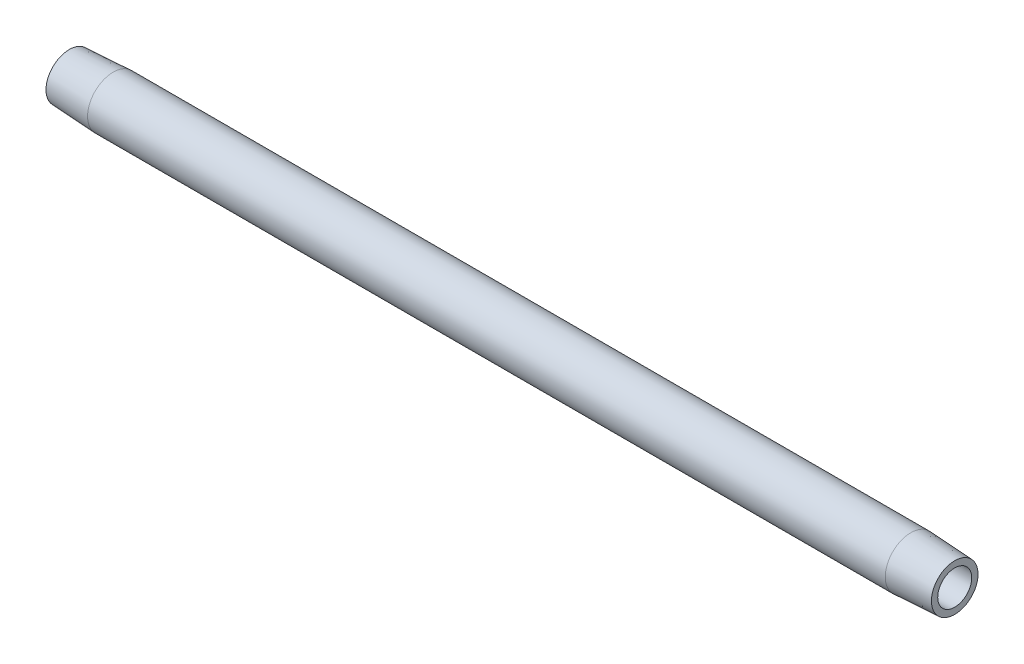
from build123d import *


with BuildPart() as part:
    # Sketch2 → Revolve1 (revolve)
    with BuildSketch(Plane.XY, mode=Mode.PRIVATE) as revolve1_sk:
        Polygon((8.810039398, 5.1435), (0, 4.6817854), (0, 3.4163), (177.8, 3.4163), (177.8, 4.6817854), (168.989960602, 5.1435), align=None)
    revolve(revolve1_sk.sketch.rotate(Axis((0.476141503, 0, 0), (1, 0, 0)), 90), axis=Axis((0.476141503, 0, 0), (1, 0, 0)))


solid = part.part
